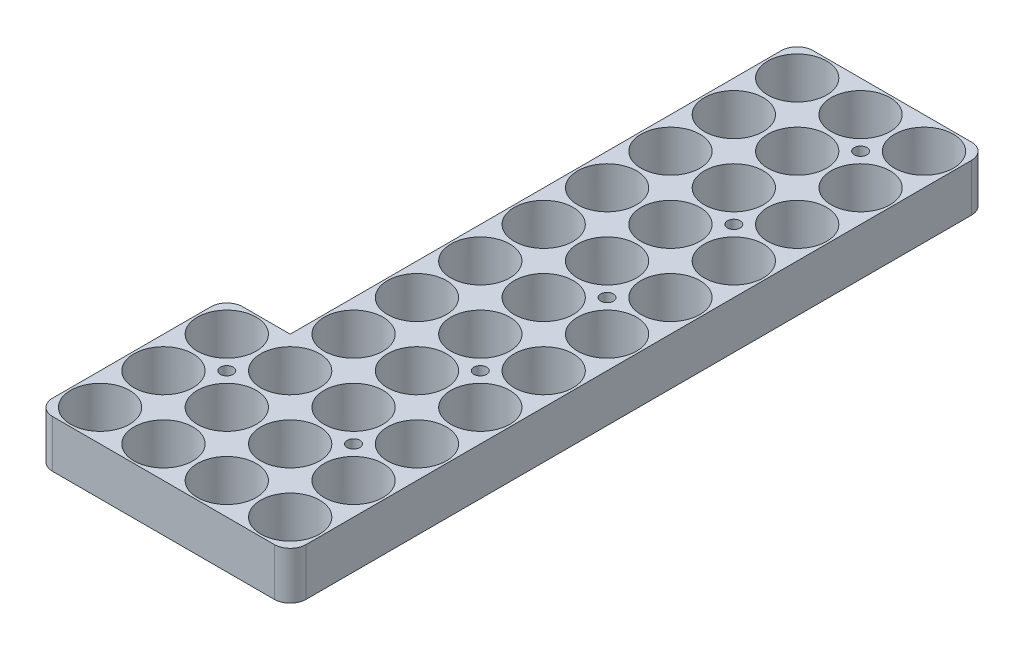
from build123d import *

# Parameters (mm, degrees)
BOSS_EXTRU_1_DEPTH                   = 15
ESQUISSE2_R                          = 9.3
ENL_V_MAT_EXTRU_1_DEPTH              = 13.5
R_P_TITION_LIN_AIRE1_COUNT           = 11
R_P_TITION_LIN_AIRE1_PITCH           = 20
R_P_TITION_LIN_AIRE1_COUNT_DIR2      = 6
R_P_TITION_LIN_AIRE1_PITCH_DIR2      = 20
ESQUISSE3_R                          = 2
ENL_V_MAT_EXTRU_2_DEPTH              = 227.108381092
R_P_TITION_LIN_AIRE2_COUNT           = 2
R_P_TITION_LIN_AIRE2_PITCH           = 40
R_P_TITION_LIN_AIRE3_COPY_1_SKETCH_R = 2
R_P_TITION_LIN_AIRE3_COPY_1_DEPTH    = 227.108381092
R_P_TITION_LIN_AIRE3_COPY_2_SKETCH_R = 2
R_P_TITION_LIN_AIRE3_COPY_2_DEPTH    = 227.108381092
R_P_TITION_LIN_AIRE3_COPY_3_SKETCH_R = 2
R_P_TITION_LIN_AIRE3_COPY_3_DEPTH    = 227.108381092
R_P_TITION_LIN_AIRE3_COPY_4_SKETCH_R = 2
R_P_TITION_LIN_AIRE3_COPY_4_DEPTH    = 227.108381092
ESQUISSE6_W                          = 58
ESQUISSE6_H                          = 10
ENL_V_MAT_EXTRU_5_DEPTH              = 1.5
R_P_TITION_LIN_AIRE6_COUNT           = 11
R_P_TITION_LIN_AIRE6_PITCH           = 20
ESQUISSE7_W                          = 10
ESQUISSE7_H                          = 58
ENL_V_MAT_EXTRU_6_DEPTH              = 1.5
ENL_V_MAT_EXTRU_7_DEPTH              = 1.5
R_P_TITION_LIN_AIRE7_COUNT           = 5
R_P_TITION_LIN_AIRE7_PITCH           = 40
R_P_TITION_LIN_AIRE7_COUNT_DIR2      = 2
R_P_TITION_LIN_AIRE7_PITCH_DIR2      = 40
ENL_V_START                          = -1.5
ENL_V_MAT_EXTRU_8_DEPTH              = 1.5
CONG_1_R                             = 5


with BuildPart() as part:
    # Esquisse1 → Boss.-Extru.1 (new body)
    with BuildSketch(Plane(origin=(0, 0, 0), x_dir=(1, 0, 0), z_dir=(0, 1, 0))):
        Polygon((30, 60), (30, 220), (-30, 220), (-30, 60), (-50, 60), (-50, 0), (30, 0), align=None)
    extrude(amount=BOSS_EXTRU_1_DEPTH)

    # Esquisse2 → Enl_v. mat.-Extru.1 (cut)
    with BuildSketch(Plane(origin=(0, 15, 0), x_dir=(1, 0, 0), z_dir=(0, 1, 0))):
        with Locations(Location((-40, 10, 0), (0, 0, 270))):
            Circle(ESQUISSE2_R)
    enl_v_mat_extru_1 = extrude(amount=-ENL_V_MAT_EXTRU_1_DEPTH, mode=Mode.SUBTRACT)

    # R_p_tition lin_aire1: Enl_v. mat.-Extru.1 11 × 6
    with Locations(*[(j * R_P_TITION_LIN_AIRE1_PITCH_DIR2, 0, -i * R_P_TITION_LIN_AIRE1_PITCH) for i in range(R_P_TITION_LIN_AIRE1_COUNT) for j in range(R_P_TITION_LIN_AIRE1_COUNT_DIR2) if (i, j) != (0, 0)]):
        add(enl_v_mat_extru_1, mode=Mode.SUBTRACT)

    # Esquisse3 → Enl_v. mat.-Extru.2 (cut, through all)
    with BuildSketch(Plane(origin=(0, 15, 0), x_dir=(1, 0, 0), z_dir=(0, 1, 0))):
        with Locations(Location((-30, 40, 0), (0, 0, 270))):
            Circle(ESQUISSE3_R)
    enl_v_mat_extru_2 = extrude(amount=-ENL_V_MAT_EXTRU_2_DEPTH, mode=Mode.SUBTRACT)

    # R_p_tition lin_aire2: Enl_v. mat.-Extru.2 ×2
    with Locations(*[(i * R_P_TITION_LIN_AIRE2_PITCH, 0, 0) for i in range(1, R_P_TITION_LIN_AIRE2_COUNT)]):
        add(enl_v_mat_extru_2, mode=Mode.SUBTRACT)

    # R_p_tition lin_aire3 copy 1 sketch → R_p_tition lin_aire3 copy 1 (cut, through all)
    with BuildSketch(Plane(origin=(40, 15, -40), x_dir=(1, 0, 0), z_dir=(0, 1, 0))):
        with Locations(Location((-30, 40, 0), (0, 0, 270))):
            Circle(R_P_TITION_LIN_AIRE3_COPY_1_SKETCH_R)
    extrude(amount=-R_P_TITION_LIN_AIRE3_COPY_1_DEPTH, mode=Mode.SUBTRACT)

    # R_p_tition lin_aire3 copy 2 sketch → R_p_tition lin_aire3 copy 2 (cut, through all)
    with BuildSketch(Plane(origin=(40, 15, -80), x_dir=(1, 0, 0), z_dir=(0, 1, 0))):
        with Locations(Location((-30, 40, 0), (0, 0, 270))):
            Circle(R_P_TITION_LIN_AIRE3_COPY_2_SKETCH_R)
    extrude(amount=-R_P_TITION_LIN_AIRE3_COPY_2_DEPTH, mode=Mode.SUBTRACT)

    # R_p_tition lin_aire3 copy 3 sketch → R_p_tition lin_aire3 copy 3 (cut, through all)
    with BuildSketch(Plane(origin=(40, 15, -120), x_dir=(1, 0, 0), z_dir=(0, 1, 0))):
        with Locations(Location((-30, 40, 0), (0, 0, 270))):
            Circle(R_P_TITION_LIN_AIRE3_COPY_3_SKETCH_R)
    extrude(amount=-R_P_TITION_LIN_AIRE3_COPY_3_DEPTH, mode=Mode.SUBTRACT)

    # R_p_tition lin_aire3 copy 4 sketch → R_p_tition lin_aire3 copy 4 (cut, through all)
    with BuildSketch(Plane(origin=(40, 15, -160), x_dir=(1, 0, 0), z_dir=(0, 1, 0))):
        with Locations(Location((-30, 40, 0), (0, 0, 270))):
            Circle(R_P_TITION_LIN_AIRE3_COPY_4_SKETCH_R)
    extrude(amount=-R_P_TITION_LIN_AIRE3_COPY_4_DEPTH, mode=Mode.SUBTRACT)

    # Esquisse6 → Enl_v. mat.-Extru.5 (cut)
    with BuildSketch(Plane.XZ):
        with Locations((0, -10)):
            Rectangle(ESQUISSE6_W, ESQUISSE6_H)
    enl_v_mat_extru_5 = extrude(amount=-ENL_V_MAT_EXTRU_5_DEPTH, mode=Mode.SUBTRACT)

    # R_p_tition lin_aire6: Enl_v. mat.-Extru.5 ×11
    with Locations(*[(0, 0, -i * R_P_TITION_LIN_AIRE6_PITCH) for i in range(1, R_P_TITION_LIN_AIRE6_COUNT)]):
        add(enl_v_mat_extru_5, mode=Mode.SUBTRACT)

    # Esquisse7 → Enl_v. mat.-Extru.6 (cut)
    with BuildSketch(Plane.XZ):
        with Locations((-40, -30)):
            Rectangle(ESQUISSE7_W, ESQUISSE7_H)
    extrude(amount=-ENL_V_MAT_EXTRU_6_DEPTH, mode=Mode.SUBTRACT)

    # Esquisse8 → Enl_v. mat.-Extru.7 (cut)
    with BuildSketch(Plane.XZ):
        Polygon((-27.841555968, -195), (-25, -197.841555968), (-25, -202.158444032), (-27.841555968, -205), (-12.158444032, -205), (-15, -202.158444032), (-15, -197.841555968), (-12.158444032, -195), align=None)
    enl_v_mat_extru_7 = extrude(amount=-ENL_V_MAT_EXTRU_7_DEPTH, mode=Mode.SUBTRACT)

    # R_p_tition lin_aire7: Enl_v. mat.-Extru.7 5 × 2
    with Locations(*[(j * R_P_TITION_LIN_AIRE7_PITCH_DIR2, 0, i * R_P_TITION_LIN_AIRE7_PITCH) for i in range(R_P_TITION_LIN_AIRE7_COUNT) for j in range(R_P_TITION_LIN_AIRE7_COUNT_DIR2) if (i, j) != (0, 0)]):
        add(enl_v_mat_extru_7, mode=Mode.SUBTRACT)

    # Esquisse9 → Enl_v. mat.-Extru.8 (cut)
    with BuildSketch(Plane.XZ.offset(ENL_V_START)):
        with BuildLine():
            Line((-29, -5), (-29, -15))
            Line((-29, -15), (-32.158444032, -15))
            ThreePointArc((-32.158444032, -15), (-33.423906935, -16.576093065), (-35, -17.841555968))
            Line((-35, -17.841555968), (-35, -2.158444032))
            ThreePointArc((-35, -2.158444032), (-33.423906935, -3.423906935), (-32.158444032, -5))
            Line((-32.158444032, -5), (-29, -5))
        make_face()
    extrude(amount=ENL_V_MAT_EXTRU_8_DEPTH, mode=Mode.SUBTRACT)

    # Cong_1
    cong_1_edges = [part.edges().sort_by_distance(p)[0] for p in [
        (-50, 7.5, 0),
        (-50, 7.5, -60),
        (-30, 7.5, -220),
        (30, 7.5, -220),
        (30, 7.5, 0),
    ]]
    fillet(cong_1_edges, radius=CONG_1_R)


solid = part.part
